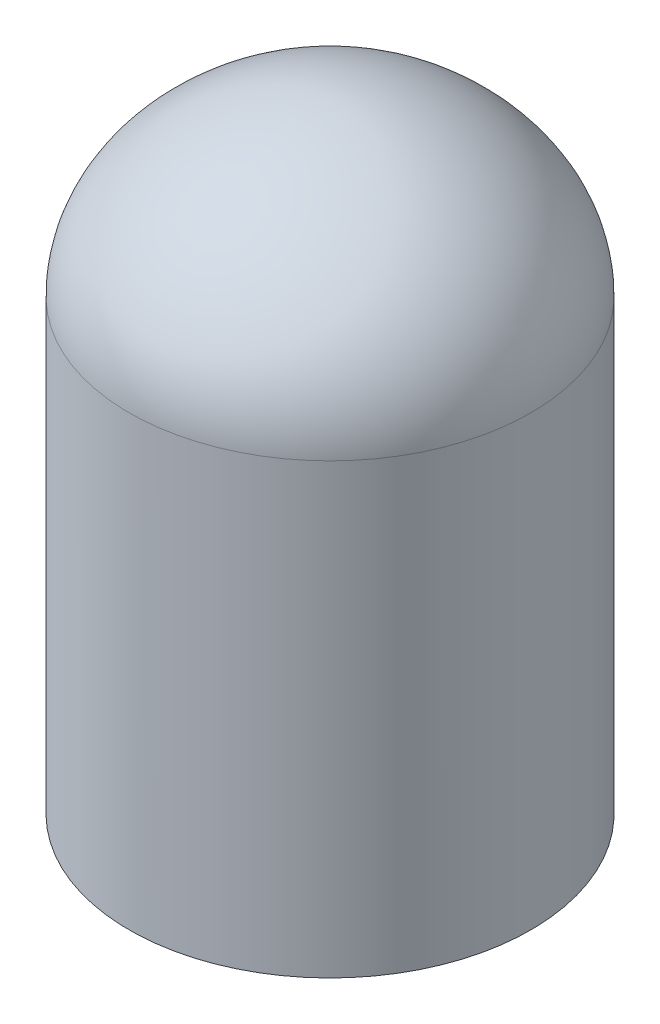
from build123d import *


with BuildPart() as part:
    # Esquisse3 → R_volution1 (revolve)
    with BuildSketch(Plane.XY.offset(334.5), mode=Mode.PRIVATE) as r_volution1_sk:
        with BuildLine():
            Line((1.62311967, 75.150030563), (7.62311967, 78.614132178))
            Line((7.62311967, 78.614132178), (7.62311967, 90.150030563))
            add(Edge.make_bspline(
                [(-11.87688033, 73.631742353), (-11.87688033, 83.220288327), (-1.155782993, 90.150030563), (7.62311967, 90.150030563)],
                knots=[0, 0, 0, 0, 1, 1, 1, 1], degree=3))
            Line((-11.87688033, 73.631742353), (-11.87688033, 30.150030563))
            Line((-11.87688033, 30.150030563), (0.62311967, 30.150030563))
            Line((0.62311967, 30.150030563), (0.62311967, 75.150030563))
            Line((0.62311967, 75.150030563), (1.62311967, 75.150030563))
        make_face()
    revolve(r_volution1_sk.sketch.rotate(Axis((7.62311967, 78.614132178, 334.5), (0, 1, 0)), 270), axis=Axis((7.62311967, 78.614132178, 334.5), (0, 1, 0)))


solid = part.part
